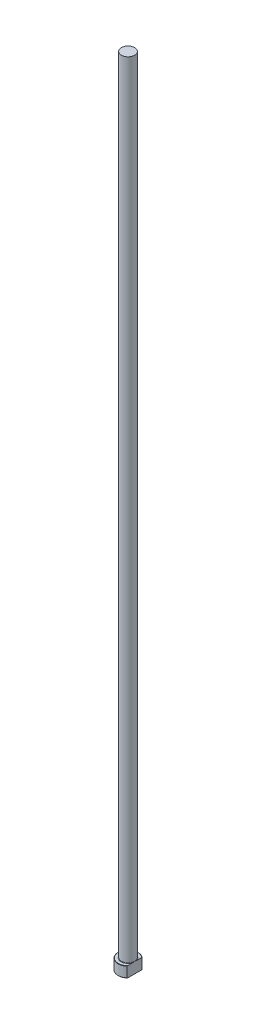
from build123d import *
from build123d.topology import SkipClean

# Parameters (mm, degrees)
CHAMFER1_SIZE    = 0.2
FILLET1_R        = 0.3
KEYED_HEAD_DEPTH = 601.093742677


with BuildPart() as part:
    # Sketch1 → Revolve1 (revolve)
    with BuildSketch(Plane.XY, mode=Mode.PRIVATE) as revolve1_sk:
        Polygon((0, 0), (-7.5, 0), (-7.5, 8), (-5, 8), (-5, 600), (0, 600), align=None)
    revolve(revolve1_sk.sketch.rotate(Axis((0, 259.958771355, 0), (0, -1, 0)), 270), axis=Axis((0, 259.958771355, 0), (0, -1, 0)))

    # Chamfer1
    chamfer1_edges = [part.edges().sort_by_distance(p)[0] for p in [
        (0, 8, -7.5),
        (0, 0, -7.5),
    ]]
    chamfer(chamfer1_edges, length=CHAMFER1_SIZE)

    # Fillet1
    fillet1_edges = [part.edges().sort_by_distance(p)[0] for p in [
        (0, 8, -5),
    ]]
    fillet(fillet1_edges, radius=FILLET1_R)

    # Sketch2 → KEYED HEAD (cut, through all)
    with SkipClean():  # the faces are left unmerged after this step: merging them gives an invalid solid
        with BuildSketch(Plane(origin=(0, 0, 0), x_dir=(1, 0, 0), z_dir=(0, 1, 0))):
            with BuildLine():
                Line((5, -5.590169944), (5, 5.590169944))
                ThreePointArc((5, 5.590169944), (7.5, 0), (5, -5.590169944))
            make_face()
        extrude(amount=KEYED_HEAD_DEPTH, mode=Mode.SUBTRACT)


solid = part.part
